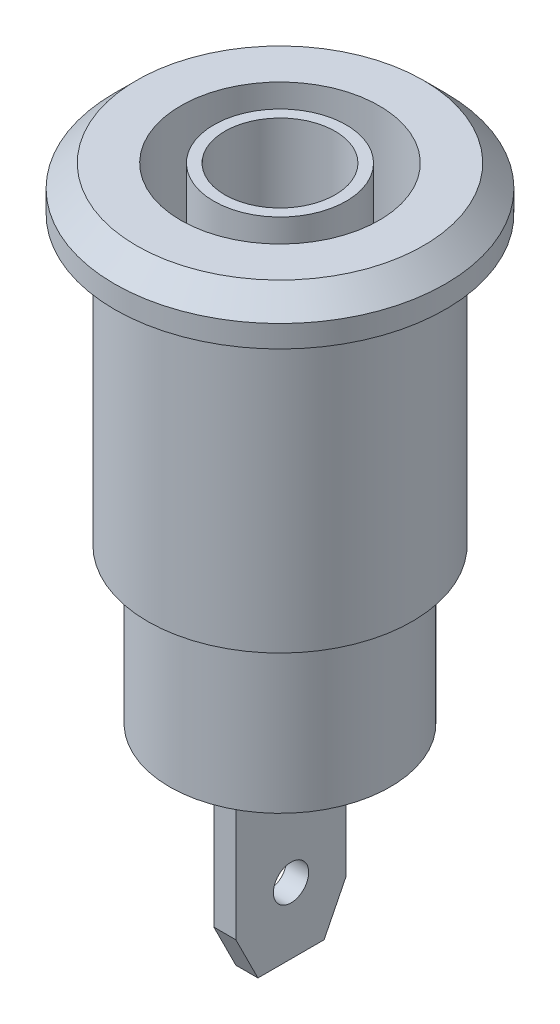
ISO-10303-21;
HEADER;
FILE_DESCRIPTION(('STEP AP214'),'2;1');
FILE_NAME('part.step','',(''),(''),'','','');
FILE_SCHEMA(('AUTOMOTIVE_DESIGN { 1 0 10303 214 1 1 1 1 }'));
ENDSEC;
DATA;
#1=APPLICATION_CONTEXT('core data for automotive mechanical design processes');
#2=APPLICATION_PROTOCOL_DEFINITION('international standard','automotive_design',2000,#1);
#3=PRODUCT_CONTEXT('',#1,'mechanical');
#4=PRODUCT('Part','Part','',(#3));
#5=PRODUCT_RELATED_PRODUCT_CATEGORY('part','',(#4));
#6=PRODUCT_DEFINITION_FORMATION('','',#4);
#7=PRODUCT_DEFINITION_CONTEXT('part definition',#1,'design');
#8=PRODUCT_DEFINITION('design','',#6,#7);
#9=PRODUCT_DEFINITION_SHAPE('','',#8);
#10=(LENGTH_UNIT() NAMED_UNIT(*) SI_UNIT(.MILLI.,.METRE.));
#11=(NAMED_UNIT(*) PLANE_ANGLE_UNIT() SI_UNIT($,.RADIAN.));
#12=(NAMED_UNIT(*) SI_UNIT($,.STERADIAN.) SOLID_ANGLE_UNIT());
#13=UNCERTAINTY_MEASURE_WITH_UNIT(LENGTH_MEASURE(1.E-05),#10,'distance_accuracy_value','');
#14=(GEOMETRIC_REPRESENTATION_CONTEXT(3) GLOBAL_UNCERTAINTY_ASSIGNED_CONTEXT((#13)) GLOBAL_UNIT_ASSIGNED_CONTEXT((#10,
#11,#12)) REPRESENTATION_CONTEXT('',''));
#15=CARTESIAN_POINT('',(0.,0.,0.));
#16=DIRECTION('',(0.,0.,1.));
#17=DIRECTION('',(1.,0.,0.));
#18=AXIS2_PLACEMENT_3D('',#15,#16,#17);
#19=CARTESIAN_POINT('',(0.,-22.,-4.99999999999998));
#20=DIRECTION('',(0.,1.,0.));
#21=DIRECTION('',(0.,0.,1.));
#22=AXIS2_PLACEMENT_3D('',#19,#20,#21);
#23=PLANE('',#22);
#24=CARTESIAN_POINT('',(0.,-22.,0.));
#25=DIRECTION('',(0.,1.,0.));
#26=DIRECTION('',(0.,0.,1.));
#27=AXIS2_PLACEMENT_3D('',#24,#25,#26);
#28=CIRCLE('',#27,5.);
#29=CARTESIAN_POINT('',(0.,-22.,5.00000000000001));
#30=VERTEX_POINT('',#29);
#31=EDGE_CURVE('E148',#30,#30,#28,.T.);
#32=ORIENTED_EDGE('',*,*,#31,.F.);
#33=EDGE_LOOP('',(#32));
#34=FACE_BOUND('',#33,.T.);
#35=DIRECTION('',(0.,0.,1.));
#36=VECTOR('',#35,1.);
#37=CARTESIAN_POINT('',(-0.500000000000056,-22.,2.5));
#38=LINE('',#37,#36);
#39=CARTESIAN_POINT('',(-0.500000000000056,-22.,-2.49999999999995));
#40=VERTEX_POINT('',#39);
#41=CARTESIAN_POINT('',(-0.500000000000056,-22.,2.5));
#42=VERTEX_POINT('',#41);
#43=EDGE_CURVE('E121',#40,#42,#38,.T.);
#44=ORIENTED_EDGE('',*,*,#43,.T.);
#45=DIRECTION('',(1.,0.,0.));
#46=VECTOR('',#45,1.);
#47=CARTESIAN_POINT('',(-0.500000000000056,-22.,2.5));
#48=LINE('',#47,#46);
#49=CARTESIAN_POINT('',(0.500000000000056,-22.,2.5));
#50=VERTEX_POINT('',#49);
#51=EDGE_CURVE('E125',#42,#50,#48,.T.);
#52=ORIENTED_EDGE('',*,*,#51,.T.);
#53=DIRECTION('',(0.,0.,1.));
#54=VECTOR('',#53,1.);
#55=CARTESIAN_POINT('',(0.500000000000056,-22.,2.5));
#56=LINE('',#55,#54);
#57=CARTESIAN_POINT('',(0.500000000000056,-22.,-2.49999999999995));
#58=VERTEX_POINT('',#57);
#59=EDGE_CURVE('E107',#58,#50,#56,.T.);
#60=ORIENTED_EDGE('',*,*,#59,.F.);
#61=DIRECTION('',(1.,0.,0.));
#62=VECTOR('',#61,1.);
#63=CARTESIAN_POINT('',(-0.500000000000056,-22.,-2.49999999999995));
#64=LINE('',#63,#62);
#65=EDGE_CURVE('E124',#40,#58,#64,.T.);
#66=ORIENTED_EDGE('',*,*,#65,.F.);
#67=EDGE_LOOP('',(#44,#52,#60,#66));
#68=FACE_BOUND('',#67,.T.);
#69=ADVANCED_FACE('F32',(#34,#68),#23,.F.);
#70=CARTESIAN_POINT('',(0.,-12.,1.11022302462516E-13));
#71=DIRECTION('',(0.,1.,0.));
#72=DIRECTION('',(0.,0.,1.));
#73=AXIS2_PLACEMENT_3D('',#70,#71,#72);
#74=PLANE('',#73);
#75=CARTESIAN_POINT('',(0.,-12.,1.11022302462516E-13));
#76=DIRECTION('',(0.,1.,0.));
#77=DIRECTION('',(0.,0.,1.));
#78=AXIS2_PLACEMENT_3D('',#75,#76,#77);
#79=CIRCLE('',#78,4.5);
#80=CARTESIAN_POINT('',(0.,-12.,4.50000000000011));
#81=VERTEX_POINT('',#80);
#82=EDGE_CURVE('E145',#81,#81,#79,.T.);
#83=ORIENTED_EDGE('',*,*,#82,.T.);
#84=EDGE_LOOP('',(#83));
#85=FACE_BOUND('',#84,.T.);
#86=CARTESIAN_POINT('',(0.,-12.,1.11022302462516E-13));
#87=DIRECTION('',(0.,1.,0.));
#88=DIRECTION('',(0.,0.,1.));
#89=AXIS2_PLACEMENT_3D('',#86,#87,#88);
#90=CIRCLE('',#89,3.);
#91=CARTESIAN_POINT('',(0.,-12.,3.00000000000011));
#92=VERTEX_POINT('',#91);
#93=EDGE_CURVE('E136',#92,#92,#90,.T.);
#94=ORIENTED_EDGE('',*,*,#93,.F.);
#95=EDGE_LOOP('',(#94));
#96=FACE_BOUND('',#95,.T.);
#97=ADVANCED_FACE('F185',(#85,#96),#74,.T.);
#98=CARTESIAN_POINT('',(0.,0.,0.));
#99=DIRECTION('',(0.,-1.,0.));
#100=DIRECTION('',(0.,0.,-1.));
#101=AXIS2_PLACEMENT_3D('',#98,#99,#100);
#102=PLANE('',#101);
#103=CARTESIAN_POINT('',(0.,0.,0.));
#104=DIRECTION('',(0.,1.,0.));
#105=DIRECTION('',(0.,0.,1.));
#106=AXIS2_PLACEMENT_3D('',#103,#104,#105);
#107=CIRCLE('',#106,4.5);
#108=CARTESIAN_POINT('',(0.,0.,4.5));
#109=VERTEX_POINT('',#108);
#110=EDGE_CURVE('E142',#109,#109,#107,.T.);
#111=ORIENTED_EDGE('',*,*,#110,.F.);
#112=EDGE_LOOP('',(#111));
#113=FACE_BOUND('',#112,.T.);
#114=CARTESIAN_POINT('',(0.,0.,0.));
#115=DIRECTION('',(0.,-1.,0.));
#116=DIRECTION('',(0.,0.,-1.));
#117=AXIS2_PLACEMENT_3D('',#114,#115,#116);
#118=CIRCLE('',#117,6.49999999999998);
#119=CARTESIAN_POINT('',(0.,0.,-6.49999999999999));
#120=VERTEX_POINT('',#119);
#121=EDGE_CURVE('E40',#120,#120,#118,.F.);
#122=ORIENTED_EDGE('',*,*,#121,.T.);
#123=EDGE_LOOP('',(#122));
#124=FACE_BOUND('',#123,.T.);
#125=ADVANCED_FACE('F34',(#113,#124),#102,.F.);
#126=CARTESIAN_POINT('',(0.,10.,0.));
#127=DIRECTION('',(0.,1.,0.));
#128=DIRECTION('',(0.,0.,1.));
#129=AXIS2_PLACEMENT_3D('',#126,#127,#128);
#130=CYLINDRICAL_SURFACE('',#129,7.5);
#131=CARTESIAN_POINT('',(0.,-1.,1.38777878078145E-13));
#132=DIRECTION('',(0.,-1.,0.));
#133=DIRECTION('',(0.,0.,-1.));
#134=AXIS2_PLACEMENT_3D('',#131,#132,#133);
#135=CIRCLE('',#134,7.5);
#136=CARTESIAN_POINT('',(0.,-1.,-7.49999999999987));
#137=VERTEX_POINT('',#136);
#138=EDGE_CURVE('E11',#137,#137,#135,.T.);
#139=ORIENTED_EDGE('',*,*,#138,.T.);
#140=EDGE_LOOP('',(#139));
#141=FACE_BOUND('',#140,.T.);
#142=CARTESIAN_POINT('',(0.,-2.,1.11022302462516E-13));
#143=DIRECTION('',(0.,1.,0.));
#144=DIRECTION('',(0.,0.,1.));
#145=AXIS2_PLACEMENT_3D('',#142,#143,#144);
#146=CIRCLE('',#145,7.5);
#147=CARTESIAN_POINT('',(0.,-2.,7.50000000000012));
#148=VERTEX_POINT('',#147);
#149=EDGE_CURVE('E160',#148,#148,#146,.T.);
#150=ORIENTED_EDGE('',*,*,#149,.T.);
#151=EDGE_LOOP('',(#150));
#152=FACE_BOUND('',#151,.T.);
#153=ADVANCED_FACE('F204',(#141,#152),#130,.T.);
#154=CARTESIAN_POINT('',(0.,-2.,-7.49999999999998));
#155=DIRECTION('',(0.,1.,0.));
#156=DIRECTION('',(0.,0.,1.));
#157=AXIS2_PLACEMENT_3D('',#154,#155,#156);
#158=PLANE('',#157);
#159=ORIENTED_EDGE('',*,*,#149,.F.);
#160=EDGE_LOOP('',(#159));
#161=FACE_BOUND('',#160,.T.);
#162=CARTESIAN_POINT('',(0.,-2.,1.11022302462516E-13));
#163=DIRECTION('',(0.,1.,0.));
#164=DIRECTION('',(0.,0.,1.));
#165=AXIS2_PLACEMENT_3D('',#162,#163,#164);
#166=CIRCLE('',#165,6.);
#167=CARTESIAN_POINT('',(0.,-2.,6.00000000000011));
#168=VERTEX_POINT('',#167);
#169=EDGE_CURVE('E157',#168,#168,#166,.T.);
#170=ORIENTED_EDGE('',*,*,#169,.T.);
#171=EDGE_LOOP('',(#170));
#172=FACE_BOUND('',#171,.T.);
#173=ADVANCED_FACE('F201',(#161,#172),#158,.F.);
#174=CARTESIAN_POINT('',(0.,10.,0.));
#175=DIRECTION('',(0.,1.,0.));
#176=DIRECTION('',(0.,0.,1.));
#177=AXIS2_PLACEMENT_3D('',#174,#175,#176);
#178=CYLINDRICAL_SURFACE('',#177,6.);
#179=ORIENTED_EDGE('',*,*,#169,.F.);
#180=EDGE_LOOP('',(#179));
#181=FACE_BOUND('',#180,.T.);
#182=CARTESIAN_POINT('',(0.,-15.,0.));
#183=DIRECTION('',(0.,1.,0.));
#184=DIRECTION('',(0.,0.,1.));
#185=AXIS2_PLACEMENT_3D('',#182,#183,#184);
#186=CIRCLE('',#185,6.);
#187=CARTESIAN_POINT('',(0.,-15.,6.));
#188=VERTEX_POINT('',#187);
#189=EDGE_CURVE('E154',#188,#188,#186,.T.);
#190=ORIENTED_EDGE('',*,*,#189,.T.);
#191=EDGE_LOOP('',(#190));
#192=FACE_BOUND('',#191,.T.);
#193=ADVANCED_FACE('F197',(#181,#192),#178,.T.);
#194=CARTESIAN_POINT('',(0.,-15.,-5.99999999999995));
#195=DIRECTION('',(0.,1.,0.));
#196=DIRECTION('',(0.,0.,1.));
#197=AXIS2_PLACEMENT_3D('',#194,#195,#196);
#198=PLANE('',#197);
#199=ORIENTED_EDGE('',*,*,#189,.F.);
#200=EDGE_LOOP('',(#199));
#201=FACE_BOUND('',#200,.T.);
#202=CARTESIAN_POINT('',(0.,-15.,0.));
#203=DIRECTION('',(0.,1.,0.));
#204=DIRECTION('',(0.,0.,1.));
#205=AXIS2_PLACEMENT_3D('',#202,#203,#204);
#206=CIRCLE('',#205,5.);
#207=CARTESIAN_POINT('',(0.,-15.,5.));
#208=VERTEX_POINT('',#207);
#209=EDGE_CURVE('E151',#208,#208,#206,.T.);
#210=ORIENTED_EDGE('',*,*,#209,.T.);
#211=EDGE_LOOP('',(#210));
#212=FACE_BOUND('',#211,.T.);
#213=ADVANCED_FACE('F179',(#201,#212),#198,.F.);
#214=CARTESIAN_POINT('',(0.,10.,0.));
#215=DIRECTION('',(0.,1.,0.));
#216=DIRECTION('',(0.,0.,1.));
#217=AXIS2_PLACEMENT_3D('',#214,#215,#216);
#218=CYLINDRICAL_SURFACE('',#217,5.);
#219=ORIENTED_EDGE('',*,*,#209,.F.);
#220=EDGE_LOOP('',(#219));
#221=FACE_BOUND('',#220,.T.);
#222=ORIENTED_EDGE('',*,*,#31,.T.);
#223=EDGE_LOOP('',(#222));
#224=FACE_BOUND('',#223,.T.);
#225=ADVANCED_FACE('F169',(#221,#224),#218,.T.);
#226=CARTESIAN_POINT('',(0.,0.,0.));
#227=DIRECTION('',(0.,-1.,0.));
#228=DIRECTION('',(0.,0.,-1.));
#229=AXIS2_PLACEMENT_3D('',#226,#227,#228);
#230=CONICAL_SURFACE('',#229,6.49999999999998,0.785398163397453);
#231=ORIENTED_EDGE('',*,*,#138,.F.);
#232=EDGE_LOOP('',(#231));
#233=FACE_BOUND('',#232,.T.);
#234=ORIENTED_EDGE('',*,*,#121,.F.);
#235=EDGE_LOOP('',(#234));
#236=FACE_BOUND('',#235,.T.);
#237=ADVANCED_FACE('F166',(#233,#236),#230,.T.);
#238=CARTESIAN_POINT('',(0.,-12.,1.11022302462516E-13));
#239=DIRECTION('',(0.,1.,0.));
#240=DIRECTION('',(0.,0.,1.));
#241=AXIS2_PLACEMENT_3D('',#238,#239,#240);
#242=CYLINDRICAL_SURFACE('',#241,4.5);
#243=ORIENTED_EDGE('',*,*,#82,.F.);
#244=EDGE_LOOP('',(#243));
#245=FACE_BOUND('',#244,.T.);
#246=ORIENTED_EDGE('',*,*,#110,.T.);
#247=EDGE_LOOP('',(#246));
#248=FACE_BOUND('',#247,.T.);
#249=ADVANCED_FACE('F168',(#245,#248),#242,.F.);
#250=CARTESIAN_POINT('',(0.,0.,0.));
#251=DIRECTION('',(0.,-1.,0.));
#252=DIRECTION('',(0.,0.,-1.));
#253=AXIS2_PLACEMENT_3D('',#250,#251,#252);
#254=CYLINDRICAL_SURFACE('',#253,3.);
#255=CARTESIAN_POINT('',(0.,0.,0.));
#256=DIRECTION('',(0.,1.,0.));
#257=DIRECTION('',(0.,0.,1.));
#258=AXIS2_PLACEMENT_3D('',#255,#256,#257);
#259=CIRCLE('',#258,3.);
#260=CARTESIAN_POINT('',(0.,0.,3.));
#261=VERTEX_POINT('',#260);
#262=EDGE_CURVE('E139',#261,#261,#259,.T.);
#263=ORIENTED_EDGE('',*,*,#262,.F.);
#264=EDGE_LOOP('',(#263));
#265=FACE_BOUND('',#264,.T.);
#266=ORIENTED_EDGE('',*,*,#93,.T.);
#267=EDGE_LOOP('',(#266));
#268=FACE_BOUND('',#267,.T.);
#269=ADVANCED_FACE('F176',(#265,#268),#254,.T.);
#270=CARTESIAN_POINT('',(0.,0.,0.));
#271=DIRECTION('',(0.,1.,0.));
#272=DIRECTION('',(0.,0.,1.));
#273=AXIS2_PLACEMENT_3D('',#270,#271,#272);
#274=PLANE('',#273);
#275=CARTESIAN_POINT('',(0.,0.,0.));
#276=DIRECTION('',(0.,1.,0.));
#277=DIRECTION('',(0.,0.,1.));
#278=AXIS2_PLACEMENT_3D('',#275,#276,#277);
#279=CIRCLE('',#278,2.5);
#280=CARTESIAN_POINT('',(0.,0.,2.5));
#281=VERTEX_POINT('',#280);
#282=EDGE_CURVE('E128',#281,#281,#279,.T.);
#283=ORIENTED_EDGE('',*,*,#282,.F.);
#284=EDGE_LOOP('',(#283));
#285=FACE_BOUND('',#284,.T.);
#286=ORIENTED_EDGE('',*,*,#262,.T.);
#287=EDGE_LOOP('',(#286));
#288=FACE_BOUND('',#287,.T.);
#289=ADVANCED_FACE('F328',(#285,#288),#274,.T.);
#290=CARTESIAN_POINT('',(0.,-12.,1.11022302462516E-13));
#291=DIRECTION('',(0.,1.,0.));
#292=DIRECTION('',(0.,0.,1.));
#293=AXIS2_PLACEMENT_3D('',#290,#291,#292);
#294=CYLINDRICAL_SURFACE('',#293,2.5);
#295=CARTESIAN_POINT('',(0.,-12.,1.11022302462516E-13));
#296=DIRECTION('',(0.,1.,0.));
#297=DIRECTION('',(0.,0.,1.));
#298=AXIS2_PLACEMENT_3D('',#295,#296,#297);
#299=CIRCLE('',#298,2.5);
#300=CARTESIAN_POINT('',(0.,-12.,2.50000000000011));
#301=VERTEX_POINT('',#300);
#302=EDGE_CURVE('E133',#301,#301,#299,.T.);
#303=ORIENTED_EDGE('',*,*,#302,.F.);
#304=EDGE_LOOP('',(#303));
#305=FACE_BOUND('',#304,.T.);
#306=ORIENTED_EDGE('',*,*,#282,.T.);
#307=EDGE_LOOP('',(#306));
#308=FACE_BOUND('',#307,.T.);
#309=ADVANCED_FACE('F239',(#305,#308),#294,.F.);
#310=CARTESIAN_POINT('',(0.,-12.,1.11022302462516E-13));
#311=DIRECTION('',(0.,1.,0.));
#312=DIRECTION('',(0.,0.,1.));
#313=AXIS2_PLACEMENT_3D('',#310,#311,#312);
#314=PLANE('',#313);
#315=ORIENTED_EDGE('',*,*,#302,.T.);
#316=EDGE_LOOP('',(#315));
#317=FACE_BOUND('',#316,.T.);
#318=ADVANCED_FACE('F234',(#317),#314,.T.);
#319=CARTESIAN_POINT('',(-0.500000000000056,-22.,2.5));
#320=DIRECTION('',(0.,0.,1.00000000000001));
#321=DIRECTION('',(0.,-1.00000000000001,0.));
#322=AXIS2_PLACEMENT_3D('',#319,#320,#321);
#323=PLANE('',#322);
#324=DIRECTION('',(1.,0.,0.));
#325=VECTOR('',#324,1.);
#326=CARTESIAN_POINT('',(-0.500000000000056,-29.,2.5));
#327=LINE('',#326,#325);
#328=CARTESIAN_POINT('',(-0.500000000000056,-29.,2.5));
#329=VERTEX_POINT('',#328);
#330=CARTESIAN_POINT('',(0.500000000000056,-29.,2.5));
#331=VERTEX_POINT('',#330);
#332=EDGE_CURVE('E109',#329,#331,#327,.T.);
#333=ORIENTED_EDGE('',*,*,#332,.T.);
#334=DIRECTION('',(0.,-1.00000000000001,0.));
#335=VECTOR('',#334,1.);
#336=CARTESIAN_POINT('',(0.500000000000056,-22.,2.5));
#337=LINE('',#336,#335);
#338=EDGE_CURVE('E105',#50,#331,#337,.T.);
#339=ORIENTED_EDGE('',*,*,#338,.F.);
#340=ORIENTED_EDGE('',*,*,#51,.F.);
#341=DIRECTION('',(0.,-1.00000000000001,0.));
#342=VECTOR('',#341,1.);
#343=CARTESIAN_POINT('',(-0.500000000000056,-22.,2.5));
#344=LINE('',#343,#342);
#345=EDGE_CURVE('E115',#42,#329,#344,.T.);
#346=ORIENTED_EDGE('',*,*,#345,.T.);
#347=EDGE_LOOP('',(#333,#339,#340,#346));
#348=FACE_BOUND('',#347,.T.);
#349=ADVANCED_FACE('F238',(#348),#323,.T.);
#350=CARTESIAN_POINT('',(-0.500000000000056,-22.,-2.49999999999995));
#351=DIRECTION('',(0.,0.,-1.00000000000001));
#352=DIRECTION('',(0.,1.00000000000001,0.));
#353=AXIS2_PLACEMENT_3D('',#350,#351,#352);
#354=PLANE('',#353);
#355=DIRECTION('',(1.,0.,0.));
#356=VECTOR('',#355,1.);
#357=CARTESIAN_POINT('',(-0.500000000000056,-29.,-2.5));
#358=LINE('',#357,#356);
#359=CARTESIAN_POINT('',(-0.500000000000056,-29.,-2.5));
#360=VERTEX_POINT('',#359);
#361=CARTESIAN_POINT('',(0.500000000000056,-29.,-2.5));
#362=VERTEX_POINT('',#361);
#363=EDGE_CURVE('E47',#360,#362,#358,.T.);
#364=ORIENTED_EDGE('',*,*,#363,.F.);
#365=DIRECTION('',(0.,1.00000000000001,0.));
#366=VECTOR('',#365,1.);
#367=CARTESIAN_POINT('',(-0.500000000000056,-22.,-2.49999999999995));
#368=LINE('',#367,#366);
#369=EDGE_CURVE('E119',#360,#40,#368,.T.);
#370=ORIENTED_EDGE('',*,*,#369,.T.);
#371=ORIENTED_EDGE('',*,*,#65,.T.);
#372=DIRECTION('',(0.,1.00000000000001,0.));
#373=VECTOR('',#372,1.);
#374=CARTESIAN_POINT('',(0.500000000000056,-22.,-2.49999999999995));
#375=LINE('',#374,#373);
#376=EDGE_CURVE('E104',#362,#58,#375,.T.);
#377=ORIENTED_EDGE('',*,*,#376,.F.);
#378=EDGE_LOOP('',(#364,#370,#371,#377));
#379=FACE_BOUND('',#378,.T.);
#380=ADVANCED_FACE('F253',(#379),#354,.T.);
#381=CARTESIAN_POINT('',(-0.500000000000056,-31.,2.50000000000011));
#382=DIRECTION('',(0.,-1.,0.));
#383=DIRECTION('',(0.,0.,-1.));
#384=AXIS2_PLACEMENT_3D('',#381,#382,#383);
#385=PLANE('',#384);
#386=DIRECTION('',(1.,0.,0.));
#387=VECTOR('',#386,1.);
#388=CARTESIAN_POINT('',(-0.500000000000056,-31.,-1.5));
#389=LINE('',#388,#387);
#390=CARTESIAN_POINT('',(-0.500000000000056,-31.,-1.5));
#391=VERTEX_POINT('',#390);
#392=CARTESIAN_POINT('',(0.500000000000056,-31.,-1.5));
#393=VERTEX_POINT('',#392);
#394=EDGE_CURVE('E85',#391,#393,#389,.T.);
#395=ORIENTED_EDGE('',*,*,#394,.T.);
#396=DIRECTION('',(0.,0.,-1.));
#397=VECTOR('',#396,1.);
#398=CARTESIAN_POINT('',(0.500000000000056,-31.,2.50000000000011));
#399=LINE('',#398,#397);
#400=CARTESIAN_POINT('',(0.500000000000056,-31.,1.50000000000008));
#401=VERTEX_POINT('',#400);
#402=EDGE_CURVE('E97',#401,#393,#399,.T.);
#403=ORIENTED_EDGE('',*,*,#402,.F.);
#404=DIRECTION('',(1.,0.,0.));
#405=VECTOR('',#404,1.);
#406=CARTESIAN_POINT('',(-0.500000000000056,-31.,1.50000000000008));
#407=LINE('',#406,#405);
#408=CARTESIAN_POINT('',(-0.500000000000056,-31.,1.50000000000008));
#409=VERTEX_POINT('',#408);
#410=EDGE_CURVE('E55',#409,#401,#407,.T.);
#411=ORIENTED_EDGE('',*,*,#410,.F.);
#412=DIRECTION('',(0.,0.,-1.));
#413=VECTOR('',#412,1.);
#414=CARTESIAN_POINT('',(-0.500000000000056,-31.,2.50000000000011));
#415=LINE('',#414,#413);
#416=EDGE_CURVE('E99',#409,#391,#415,.T.);
#417=ORIENTED_EDGE('',*,*,#416,.T.);
#418=EDGE_LOOP('',(#395,#403,#411,#417));
#419=FACE_BOUND('',#418,.T.);
#420=ADVANCED_FACE('F96',(#419),#385,.T.);
#421=CARTESIAN_POINT('',(-0.500000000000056,-31.,2.50000000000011));
#422=DIRECTION('',(1.,0.,0.));
#423=DIRECTION('',(0.,0.,-1.));
#424=AXIS2_PLACEMENT_3D('',#421,#422,#423);
#425=PLANE('',#424);
#426=CARTESIAN_POINT('',(-0.500000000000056,-28.,0.));
#427=DIRECTION('',(1.,0.,0.));
#428=DIRECTION('',(0.,0.,-1.));
#429=AXIS2_PLACEMENT_3D('',#426,#427,#428);
#430=CIRCLE('',#429,0.8);
#431=CARTESIAN_POINT('',(-0.500000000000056,-28.,-0.799999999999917));
#432=VERTEX_POINT('',#431);
#433=EDGE_CURVE('E91',#432,#432,#430,.T.);
#434=ORIENTED_EDGE('',*,*,#433,.T.);
#435=EDGE_LOOP('',(#434));
#436=FACE_BOUND('',#435,.T.);
#437=ORIENTED_EDGE('',*,*,#369,.F.);
#438=DIRECTION('',(0.,-0.894427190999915,0.447213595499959));
#439=VECTOR('',#438,1.);
#440=CARTESIAN_POINT('',(-0.500000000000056,-29.,-2.5));
#441=LINE('',#440,#439);
#442=EDGE_CURVE('E90',#360,#391,#441,.T.);
#443=ORIENTED_EDGE('',*,*,#442,.T.);
#444=ORIENTED_EDGE('',*,*,#416,.F.);
#445=DIRECTION('',(0.,0.894427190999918,0.447213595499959));
#446=VECTOR('',#445,1.);
#447=CARTESIAN_POINT('',(-0.500000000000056,-29.,2.5));
#448=LINE('',#447,#446);
#449=EDGE_CURVE('E414',#409,#329,#448,.T.);
#450=ORIENTED_EDGE('',*,*,#449,.T.);
#451=ORIENTED_EDGE('',*,*,#345,.F.);
#452=ORIENTED_EDGE('',*,*,#43,.F.);
#453=EDGE_LOOP('',(#437,#443,#444,#450,#451,#452));
#454=FACE_BOUND('',#453,.T.);
#455=ADVANCED_FACE('F268',(#436,#454),#425,.F.);
#456=CARTESIAN_POINT('',(0.500000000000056,-31.,2.50000000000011));
#457=DIRECTION('',(1.,0.,0.));
#458=DIRECTION('',(0.,0.,-1.));
#459=AXIS2_PLACEMENT_3D('',#456,#457,#458);
#460=PLANE('',#459);
#461=CARTESIAN_POINT('',(0.500000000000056,-28.,0.));
#462=DIRECTION('',(1.,0.,0.));
#463=DIRECTION('',(0.,0.,-1.));
#464=AXIS2_PLACEMENT_3D('',#461,#462,#463);
#465=CIRCLE('',#464,0.8);
#466=CARTESIAN_POINT('',(0.500000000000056,-28.,-0.799999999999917));
#467=VERTEX_POINT('',#466);
#468=EDGE_CURVE('E407',#467,#467,#465,.T.);
#469=ORIENTED_EDGE('',*,*,#468,.F.);
#470=EDGE_LOOP('',(#469));
#471=FACE_BOUND('',#470,.T.);
#472=DIRECTION('',(0.,-0.894427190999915,0.447213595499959));
#473=VECTOR('',#472,1.);
#474=CARTESIAN_POINT('',(0.500000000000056,-29.,-2.5));
#475=LINE('',#474,#473);
#476=EDGE_CURVE('E82',#362,#393,#475,.T.);
#477=ORIENTED_EDGE('',*,*,#476,.F.);
#478=ORIENTED_EDGE('',*,*,#376,.T.);
#479=ORIENTED_EDGE('',*,*,#59,.T.);
#480=ORIENTED_EDGE('',*,*,#338,.T.);
#481=DIRECTION('',(0.,0.894427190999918,0.447213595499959));
#482=VECTOR('',#481,1.);
#483=CARTESIAN_POINT('',(0.500000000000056,-29.,2.5));
#484=LINE('',#483,#482);
#485=EDGE_CURVE('E100',#401,#331,#484,.T.);
#486=ORIENTED_EDGE('',*,*,#485,.F.);
#487=ORIENTED_EDGE('',*,*,#402,.T.);
#488=EDGE_LOOP('',(#477,#478,#479,#480,#486,#487));
#489=FACE_BOUND('',#488,.T.);
#490=ADVANCED_FACE('F102',(#471,#489),#460,.T.);
#491=CARTESIAN_POINT('',(-0.500000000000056,-29.,2.5));
#492=DIRECTION('',(0.,0.447213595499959,-0.894427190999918));
#493=DIRECTION('',(0.,0.894427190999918,0.447213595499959));
#494=AXIS2_PLACEMENT_3D('',#491,#492,#493);
#495=PLANE('',#494);
#496=ORIENTED_EDGE('',*,*,#485,.T.);
#497=ORIENTED_EDGE('',*,*,#332,.F.);
#498=ORIENTED_EDGE('',*,*,#449,.F.);
#499=ORIENTED_EDGE('',*,*,#410,.T.);
#500=EDGE_LOOP('',(#496,#497,#498,#499));
#501=FACE_BOUND('',#500,.T.);
#502=ADVANCED_FACE('F282',(#501),#495,.F.);
#503=CARTESIAN_POINT('',(-0.500000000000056,-29.,-2.5));
#504=DIRECTION('',(0.,0.44721359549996,0.894427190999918));
#505=DIRECTION('',(0.,-0.894427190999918,0.44721359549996));
#506=AXIS2_PLACEMENT_3D('',#503,#504,#505);
#507=PLANE('',#506);
#508=ORIENTED_EDGE('',*,*,#476,.T.);
#509=ORIENTED_EDGE('',*,*,#394,.F.);
#510=ORIENTED_EDGE('',*,*,#442,.F.);
#511=ORIENTED_EDGE('',*,*,#363,.T.);
#512=EDGE_LOOP('',(#508,#509,#510,#511));
#513=FACE_BOUND('',#512,.T.);
#514=ADVANCED_FACE('F84',(#513),#507,.F.);
#515=CARTESIAN_POINT('',(-0.500000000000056,-28.,0.));
#516=DIRECTION('',(1.,0.,0.));
#517=DIRECTION('',(0.,0.,-1.));
#518=AXIS2_PLACEMENT_3D('',#515,#516,#517);
#519=CYLINDRICAL_SURFACE('',#518,0.8);
#520=ORIENTED_EDGE('',*,*,#433,.F.);
#521=EDGE_LOOP('',(#520));
#522=FACE_BOUND('',#521,.T.);
#523=ORIENTED_EDGE('',*,*,#468,.T.);
#524=EDGE_LOOP('',(#523));
#525=FACE_BOUND('',#524,.T.);
#526=ADVANCED_FACE('F296',(#522,#525),#519,.F.);
#527=CLOSED_SHELL('',(#69,#97,#125,#153,#173,#193,#213,#225,#237,#249,#269,#289,#309,#318,#349,
#380,#420,#455,#490,#502,#514,#526));
#528=MANIFOLD_SOLID_BREP('B2',#527);
#529=ADVANCED_BREP_SHAPE_REPRESENTATION('',(#18,#528),#14);
#530=SHAPE_DEFINITION_REPRESENTATION(#9,#529);
ENDSEC;
END-ISO-10303-21;
